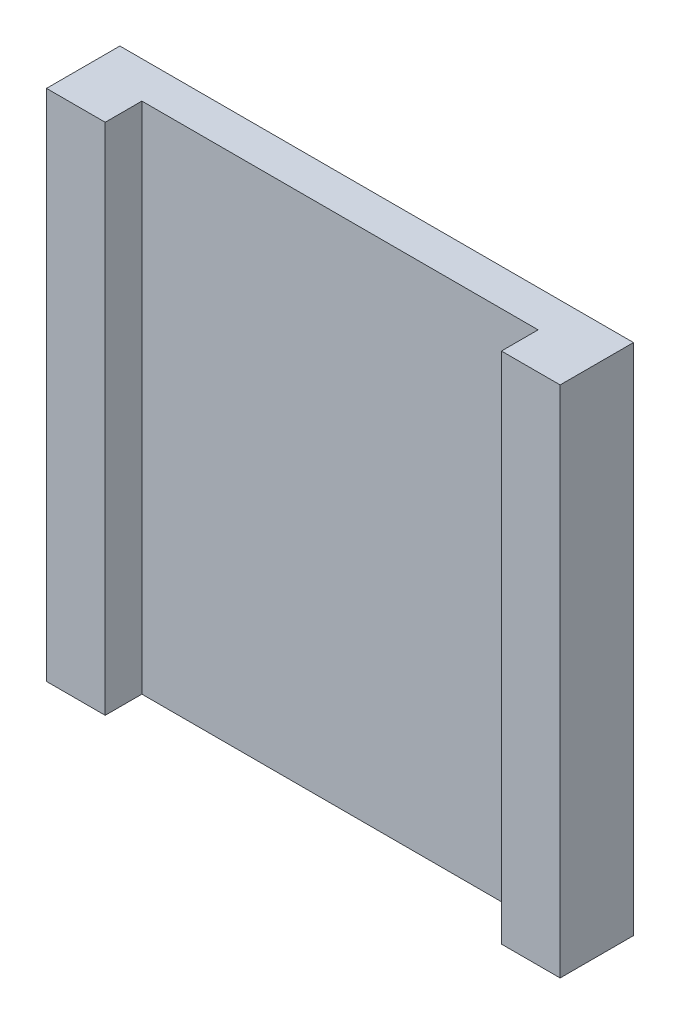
from build123d import *

# Parameters (mm, degrees)
SKETCH1_W          = 88.9
SKETCH1_H          = 88.9
EXTRUDE1_DEPTH     = 12.7
SKETCH2_W          = 68.58
SKETCH2_H          = 108.445385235
CUT_EXTRUDE1_DEPTH = 6.35


with BuildPart() as part:
    # Sketch1 → Extrude1 (new body)
    with BuildSketch(Plane.XY):
        with Locations((44.45, 44.45)):
            Rectangle(SKETCH1_W, SKETCH1_H)
    extrude(amount=EXTRUDE1_DEPTH)

    # Sketch2 → Cut-Extrude1 (cut)
    with BuildSketch(Plane.XY.offset(12.7)):
        with Locations((44.45, 44.037599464)):
            Rectangle(SKETCH2_W, SKETCH2_H)
    extrude(amount=-CUT_EXTRUDE1_DEPTH, mode=Mode.SUBTRACT)


solid = part.part
